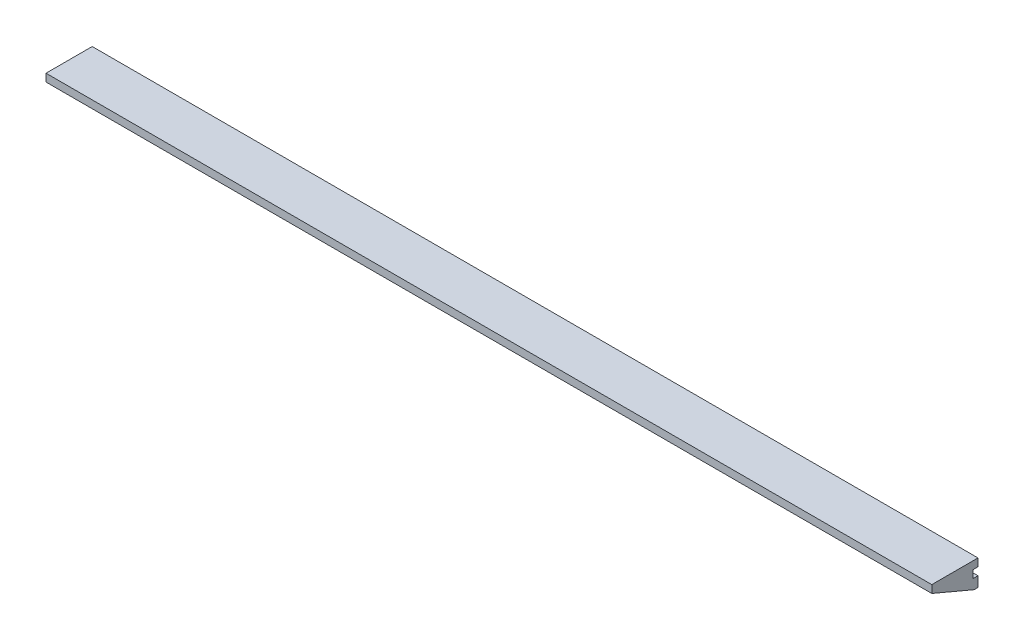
from build123d import *

# Parameters (mm, degrees)
BOSS_EXTRUDE1_DEPTH = 365.125


with BuildPart() as part:
    # Sketch1 → Boss-Extrude1 (new, symmetric)
    with BuildSketch(Plane(origin=(0, 0, 0), x_dir=(0, 0, -1), z_dir=(1, 0, 0))):
        Polygon((-19.05, 4.2037), (15.875, -10.5537), (19.05, -10.5537), (19.05, -2.1463), (15.0876, -2.1463), (15.0876, 4.2037), (19.05, 4.2037), (19.05, 10.5537), (-19.05, 10.5537), align=None)
    extrude(amount=BOSS_EXTRUDE1_DEPTH, both=True)


solid = part.part
